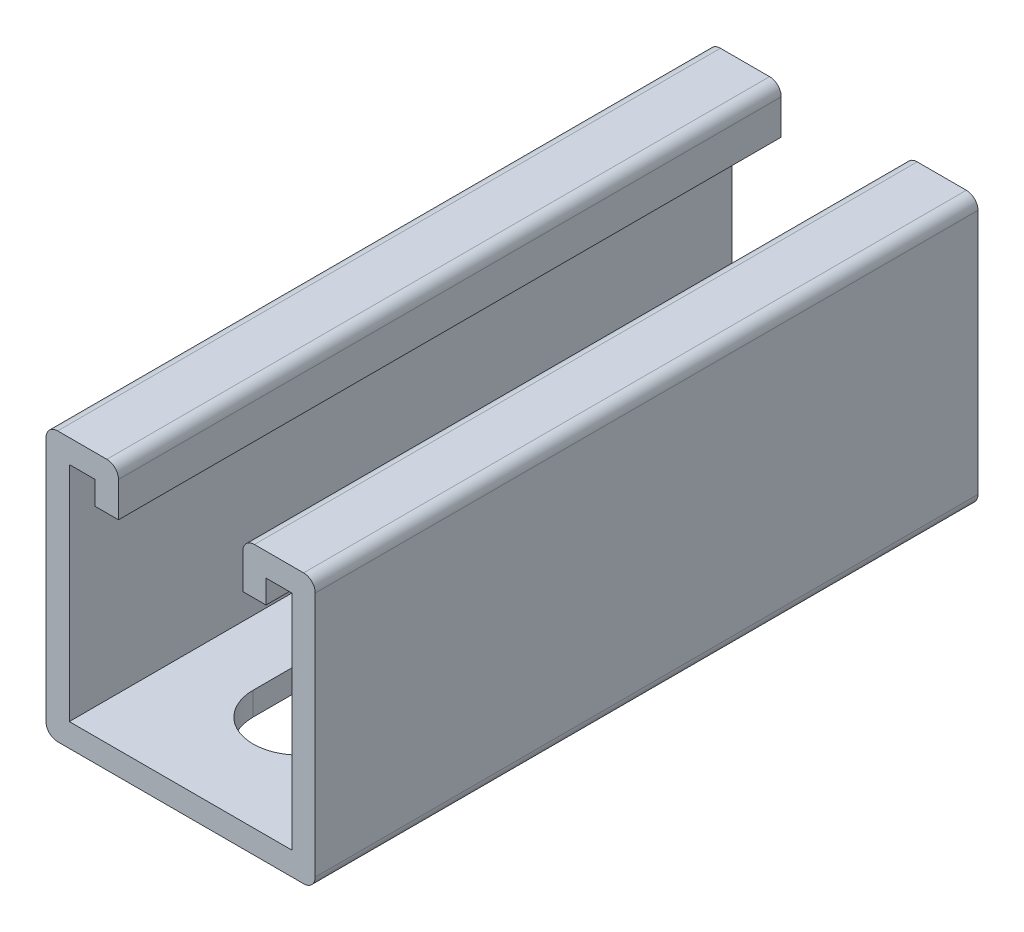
from build123d import *

# Parameters (mm, degrees)
BASE_EXTRUDE_DEPTH = 101.6
SLOT_DEPTH         = 112.588942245
LPATTERN1_COUNT    = 2
LPATTERN1_PITCH    = 50.8


with BuildPart() as part:
    # Sketch1 → Base-Extrude (new body)
    with BuildSketch(Plane.XY):
        with BuildLine():
            Line((-11.3109375, 20.6375), (-18.8515625, 20.6375))
            ThreePointArc((-18.8515625, 20.6375), (-20.114411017, 20.114411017), (-20.6375, 18.8515625))
            Line((-20.6375, 18.8515625), (-20.6375, -18.8515625))
            ThreePointArc((-20.6375, -18.8515625), (-20.114411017, -20.114411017), (-18.8515625, -20.6375))
            Line((-18.8515625, -20.6375), (18.8515625, -20.6375))
            ThreePointArc((18.8515625, -20.6375), (20.114411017, -20.114411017), (20.6375, -18.8515625))
            Line((20.6375, -18.8515625), (20.6375, 18.8515625))
            ThreePointArc((20.6375, 18.8515625), (20.114411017, 20.114411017), (18.8515625, 20.6375))
            Line((18.8515625, 20.6375), (11.3109375, 20.6375))
            ThreePointArc((11.3109375, 20.6375), (10.048088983, 20.114411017), (9.525, 18.8515625))
            Line((9.525, 18.8515625), (9.525, 13.49375))
            Line((9.525, 13.49375), (13.096875, 13.49375))
            Line((13.096875, 13.49375), (13.096875, 17.065625))
            Line((13.096875, 17.065625), (17.065625, 17.065625))
            Line((17.065625, 17.065625), (17.065625, -17.065625))
            Line((17.065625, -17.065625), (-17.065625, -17.065625))
            Line((-17.065625, -17.065625), (-17.065625, 17.065625))
            Line((-17.065625, 17.065625), (-13.096875, 17.065625))
            Line((-13.096875, 17.065625), (-13.096875, 13.49375))
            Line((-13.096875, 13.49375), (-9.525, 13.49375))
            Line((-9.525, 13.49375), (-9.525, 18.8515625))
            ThreePointArc((-9.525, 18.8515625), (-10.048088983, 20.114411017), (-11.3109375, 20.6375))
        make_face()
    extrude(amount=BASE_EXTRUDE_DEPTH)

    # Sketch2 → Slot (cut, through all)
    with BuildSketch(Plane.XZ.offset(20.6375)):
        with BuildLine():
            Line((7.14375, 32.54375), (7.14375, 18.25625))
            ThreePointArc((7.14375, 18.25625), (0, 11.1125), (-7.14375, 18.25625))
            Line((-7.14375, 18.25625), (-7.14375, 32.54375))
            ThreePointArc((-7.14375, 32.54375), (0, 39.6875), (7.14375, 32.54375))
        make_face()
    slot = extrude(amount=-SLOT_DEPTH, mode=Mode.SUBTRACT)

    # LPattern1: Slot ×2
    with Locations(*[(0, 0, i * LPATTERN1_PITCH) for i in range(1, LPATTERN1_COUNT)]):
        add(slot, mode=Mode.SUBTRACT)


solid = part.part
